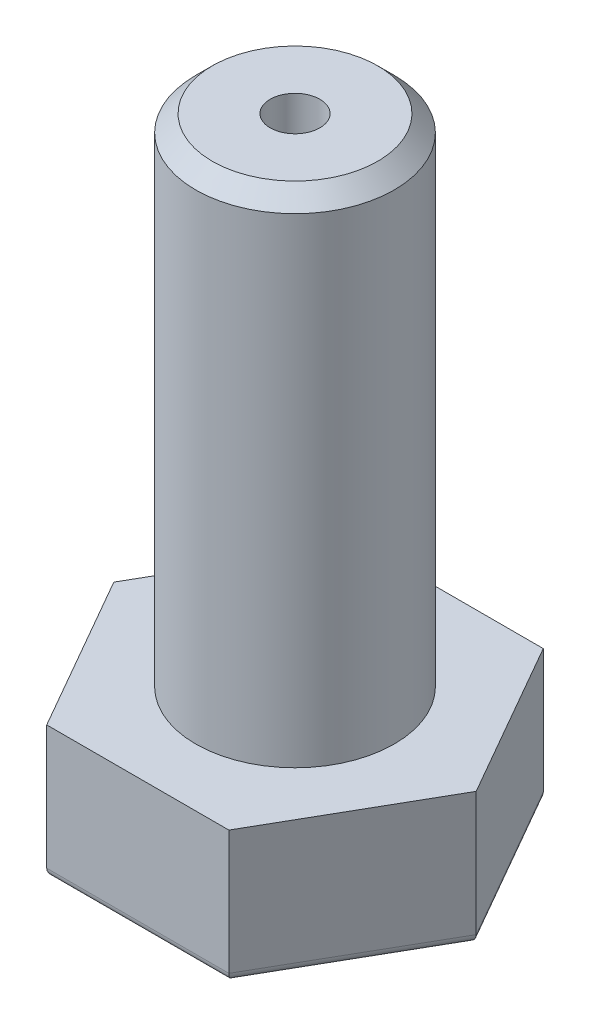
from build123d import *

# Parameters (mm, degrees)
EXTRUSION1_DEPTH                        = 8
CONG_1_R                                = 0.5
ESQUISSE2_R                             = 6
EXTRUSION2_DEPTH                        = 30
CHANFREIN1_SIZE                         = 1
DIAM_TRE_DU_PER_AGE_3_0_3_1_D           = 3
DIAM_TRE_DU_PER_AGE_3_0_3_1_ON_FACE_2_D = 3
TROU_TARAUD_M8X1_251_D                  = 6.8
TROU_TARAUD_M8X1_251_DEPTH              = 9.75
TROU_TARAUD_M8X1_251_CBORE_D            = 8
TROU_TARAUD_M8X1_251_CBORE_DEPTH        = 6
TROU_TARAUD_M8X1_251_TIP                = 2.042926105


with BuildPart() as part:
    # Esquisse1 → Extrusion1 (new body)
    with BuildSketch(Plane(origin=(0, 0, 0), x_dir=(1, 0, 0), z_dir=(0, 1, 0))):
        Polygon((-5.504589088, 9.5), (5.504589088, 9.5), (10.95, 0), (5.504589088, -9.5), (-5.504589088, -9.5), (-10.95, 0), align=None)
    extrude(amount=EXTRUSION1_DEPTH)

    # Cong_1
    cong_1_edges = [part.edges().sort_by_distance(p)[0] for p in [
        (-8.227294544, 0, 4.75),
        (-8.227294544, 0, -4.75),
        (0, 0, -9.5),
        (8.227294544, 0, -4.75),
        (8.227294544, 0, 4.75),
        (0, 0, 9.5),
    ]]
    fillet(cong_1_edges, radius=CONG_1_R)

    # Esquisse2 → Extrusion2 (add)
    with BuildSketch(Plane(origin=(0, 8, 0), x_dir=(-1, 0, 0), z_dir=(0, 1, 0))):
        with Locations(Location((0, 0, 0), (0, 0, 90))):
            Circle(ESQUISSE2_R)
    extrude(amount=EXTRUSION2_DEPTH)

    # Chanfrein1
    chanfrein1_edges = [part.edges().sort_by_distance(p)[0] for p in [
        (0, 38, -6),
    ]]
    chamfer(chanfrein1_edges, length=CHANFREIN1_SIZE)

    # Diam_tre du per_age _3.0 _3_1 (through all)
    with Locations(Plane(origin=(0, 0, 0), x_dir=(0, 0, -1), z_dir=(0, -1, 0))):
        with Locations((0, 0)):
            Hole(DIAM_TRE_DU_PER_AGE_3_0_3_1_D / 2)

    # Diam_tre du per_age _3.0 _3_1 on face 2 (through all)
    with Locations(Plane.ZX.offset(38)):
        with Locations((0, 0)):
            Hole(DIAM_TRE_DU_PER_AGE_3_0_3_1_ON_FACE_2_D / 2)

    # Trou taraud_ M8x1.251
    with Locations(Plane(origin=(0, 0, 0), x_dir=(0, 0, -1), z_dir=(0, -1, 0))):
        with Locations((0, 0)):
            CounterBoreHole(TROU_TARAUD_M8X1_251_D / 2, TROU_TARAUD_M8X1_251_CBORE_D / 2, TROU_TARAUD_M8X1_251_CBORE_DEPTH, depth=TROU_TARAUD_M8X1_251_DEPTH)
            with Locations((0, 0, -(TROU_TARAUD_M8X1_251_DEPTH + TROU_TARAUD_M8X1_251_TIP / 2))):  # 118° drill point
                Cone(0, TROU_TARAUD_M8X1_251_D / 2, TROU_TARAUD_M8X1_251_TIP, mode=Mode.SUBTRACT)


solid = part.part
